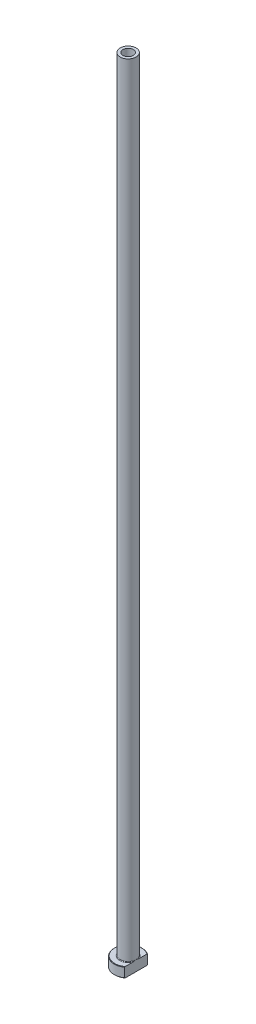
ISO-10303-21;
HEADER;
FILE_DESCRIPTION(('STEP AP214'),'2;1');
FILE_NAME('part.step','',(''),(''),'','','');
FILE_SCHEMA(('AUTOMOTIVE_DESIGN { 1 0 10303 214 1 1 1 1 }'));
ENDSEC;
DATA;
#1=APPLICATION_CONTEXT('core data for automotive mechanical design processes');
#2=APPLICATION_PROTOCOL_DEFINITION('international standard','automotive_design',2000,#1);
#3=PRODUCT_CONTEXT('',#1,'mechanical');
#4=PRODUCT('Part','Part','',(#3));
#5=PRODUCT_RELATED_PRODUCT_CATEGORY('part','',(#4));
#6=PRODUCT_DEFINITION_FORMATION('','',#4);
#7=PRODUCT_DEFINITION_CONTEXT('part definition',#1,'design');
#8=PRODUCT_DEFINITION('design','',#6,#7);
#9=PRODUCT_DEFINITION_SHAPE('','',#8);
#10=(LENGTH_UNIT() NAMED_UNIT(*) SI_UNIT(.MILLI.,.METRE.));
#11=(NAMED_UNIT(*) PLANE_ANGLE_UNIT() SI_UNIT($,.RADIAN.));
#12=(NAMED_UNIT(*) SI_UNIT($,.STERADIAN.) SOLID_ANGLE_UNIT());
#13=UNCERTAINTY_MEASURE_WITH_UNIT(LENGTH_MEASURE(1.E-05),#10,'distance_accuracy_value','');
#14=(GEOMETRIC_REPRESENTATION_CONTEXT(3) GLOBAL_UNCERTAINTY_ASSIGNED_CONTEXT((#13)) GLOBAL_UNIT_ASSIGNED_CONTEXT((#10,
#11,#12)) REPRESENTATION_CONTEXT('',''));
#15=CARTESIAN_POINT('',(0.,0.,0.));
#16=DIRECTION('',(0.,0.,1.));
#17=DIRECTION('',(1.,0.,0.));
#18=AXIS2_PLACEMENT_3D('',#15,#16,#17);
#19=CARTESIAN_POINT('',(0.,92.1876809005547,0.));
#20=DIRECTION('',(0.,1.,0.));
#21=DIRECTION('',(0.,0.,1.));
#22=AXIS2_PLACEMENT_3D('',#19,#20,#21);
#23=CYLINDRICAL_SURFACE('',#22,2.60000000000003);
#24=CARTESIAN_POINT('',(0.,400.,0.));
#25=DIRECTION('',(0.,1.,0.));
#26=DIRECTION('',(0.,0.,1.));
#27=AXIS2_PLACEMENT_3D('',#24,#25,#26);
#28=CIRCLE('',#27,2.60000000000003);
#29=CARTESIAN_POINT('',(0.,400.,2.60000000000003));
#30=VERTEX_POINT('',#29);
#31=EDGE_CURVE('E167',#30,#30,#28,.T.);
#32=ORIENTED_EDGE('',*,*,#31,.T.);
#33=EDGE_LOOP('',(#32));
#34=FACE_BOUND('',#33,.T.);
#35=CARTESIAN_POINT('',(0.,355.,0.));
#36=DIRECTION('',(0.,1.,0.));
#37=DIRECTION('',(0.,0.,1.));
#38=AXIS2_PLACEMENT_3D('',#35,#36,#37);
#39=CIRCLE('',#38,2.60000000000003);
#40=CARTESIAN_POINT('',(0.,355.,2.60000000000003));
#41=VERTEX_POINT('',#40);
#42=EDGE_CURVE('E170',#41,#41,#39,.T.);
#43=ORIENTED_EDGE('',*,*,#42,.F.);
#44=EDGE_LOOP('',(#43));
#45=FACE_BOUND('',#44,.T.);
#46=ADVANCED_FACE('F32',(#34,#45),#23,.F.);
#47=CARTESIAN_POINT('',(-2.60000000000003,400.,0.));
#48=DIRECTION('',(0.,1.,0.));
#49=DIRECTION('',(0.,0.,1.));
#50=AXIS2_PLACEMENT_3D('',#47,#48,#49);
#51=PLANE('',#50);
#52=CARTESIAN_POINT('',(0.,400.,0.));
#53=DIRECTION('',(0.,1.,0.));
#54=DIRECTION('',(0.,0.,1.));
#55=AXIS2_PLACEMENT_3D('',#52,#53,#54);
#56=CIRCLE('',#55,4.00000000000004);
#57=CARTESIAN_POINT('',(0.,400.,4.00000000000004));
#58=VERTEX_POINT('',#57);
#59=EDGE_CURVE('E174',#58,#58,#56,.T.);
#60=ORIENTED_EDGE('',*,*,#59,.T.);
#61=EDGE_LOOP('',(#60));
#62=FACE_BOUND('',#61,.T.);
#63=ORIENTED_EDGE('',*,*,#31,.F.);
#64=EDGE_LOOP('',(#63));
#65=FACE_BOUND('',#64,.T.);
#66=ADVANCED_FACE('F157',(#62,#65),#51,.T.);
#67=CARTESIAN_POINT('',(0.,92.1876809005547,0.));
#68=DIRECTION('',(0.,1.,0.));
#69=DIRECTION('',(0.,0.,1.));
#70=AXIS2_PLACEMENT_3D('',#67,#68,#69);
#71=CYLINDRICAL_SURFACE('',#70,4.00000000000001);
#72=CARTESIAN_POINT('',(0.,5.3,0.));
#73=DIRECTION('',(0.,1.,0.));
#74=DIRECTION('',(0.,0.,1.));
#75=AXIS2_PLACEMENT_3D('',#72,#73,#74);
#76=CIRCLE('',#75,4.00000000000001);
#77=CARTESIAN_POINT('',(4.00000000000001,5.3,0.));
#78=VERTEX_POINT('',#77);
#79=EDGE_CURVE('E180',#78,#78,#76,.T.);
#80=ORIENTED_EDGE('',*,*,#79,.T.);
#81=EDGE_LOOP('',(#80));
#82=FACE_BOUND('',#81,.T.);
#83=ORIENTED_EDGE('',*,*,#59,.F.);
#84=EDGE_LOOP('',(#83));
#85=FACE_BOUND('',#84,.T.);
#86=ADVANCED_FACE('F162',(#82,#85),#71,.T.);
#87=CARTESIAN_POINT('',(-3.99999999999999,5.,0.));
#88=DIRECTION('',(0.,1.,0.));
#89=DIRECTION('',(0.,0.,1.));
#90=AXIS2_PLACEMENT_3D('',#87,#88,#89);
#91=PLANE('',#90);
#92=DIRECTION('',(0.,0.,1.));
#93=VECTOR('',#92,1.);
#94=CARTESIAN_POINT('',(4.,5.,0.));
#95=LINE('',#94,#93);
#96=CARTESIAN_POINT('',(4.,5.,-5.49909083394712));
#97=VERTEX_POINT('',#96);
#98=CARTESIAN_POINT('',(4.,5.,-1.577973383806));
#99=VERTEX_POINT('',#98);
#100=EDGE_CURVE('E54',#97,#99,#95,.T.);
#101=ORIENTED_EDGE('',*,*,#100,.F.);
#102=CARTESIAN_POINT('',(0.,5.,0.));
#103=DIRECTION('',(0.,1.,0.));
#104=DIRECTION('',(0.,0.,1.));
#105=AXIS2_PLACEMENT_3D('',#102,#103,#104);
#106=CIRCLE('',#105,6.80000000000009);
#107=CARTESIAN_POINT('',(3.99999999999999,5.,5.49909083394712));
#108=VERTEX_POINT('',#107);
#109=EDGE_CURVE('E186',#97,#108,#106,.T.);
#110=ORIENTED_EDGE('',*,*,#109,.T.);
#111=CARTESIAN_POINT('',(4.,5.,1.577973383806));
#112=VERTEX_POINT('',#111);
#113=EDGE_CURVE('E134',#112,#108,#95,.T.);
#114=ORIENTED_EDGE('',*,*,#113,.F.);
#115=CARTESIAN_POINT('',(0.,5.,0.));
#116=DIRECTION('',(0.,1.,0.));
#117=DIRECTION('',(0.,0.,1.));
#118=AXIS2_PLACEMENT_3D('',#115,#116,#117);
#119=CIRCLE('',#118,4.30000000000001);
#120=EDGE_CURVE('E183',#112,#99,#119,.F.);
#121=ORIENTED_EDGE('',*,*,#120,.T.);
#122=EDGE_LOOP('',(#101,#110,#114,#121));
#123=FACE_BOUND('',#122,.T.);
#124=ADVANCED_FACE('F197',(#123),#91,.T.);
#125=CARTESIAN_POINT('',(0.,92.1876809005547,0.));
#126=DIRECTION('',(0.,1.,0.));
#127=DIRECTION('',(0.,0.,1.));
#128=AXIS2_PLACEMENT_3D('',#125,#126,#127);
#129=CYLINDRICAL_SURFACE('',#128,6.99999999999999);
#130=DIRECTION('',(0.,-1.,0.));
#131=VECTOR('',#130,1.);
#132=CARTESIAN_POINT('',(3.99999999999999,400.,5.74456264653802));
#133=LINE('',#132,#131);
#134=CARTESIAN_POINT('',(3.99999999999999,4.80000000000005,5.74456264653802));
#135=VERTEX_POINT('',#134);
#136=CARTESIAN_POINT('',(3.99999999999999,0.200000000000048,5.74456264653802));
#137=VERTEX_POINT('',#136);
#138=EDGE_CURVE('E82',#135,#137,#133,.T.);
#139=ORIENTED_EDGE('',*,*,#138,.F.);
#140=CARTESIAN_POINT('',(0.,4.80000000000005,0.));
#141=DIRECTION('',(0.,1.,0.));
#142=DIRECTION('',(0.,0.,1.));
#143=AXIS2_PLACEMENT_3D('',#140,#141,#142);
#144=CIRCLE('',#143,6.99999999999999);
#145=CARTESIAN_POINT('',(4.,4.80000000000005,-5.74456264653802));
#146=VERTEX_POINT('',#145);
#147=EDGE_CURVE('E95',#135,#146,#144,.F.);
#148=ORIENTED_EDGE('',*,*,#147,.T.);
#149=DIRECTION('',(0.,-1.,0.));
#150=VECTOR('',#149,1.);
#151=CARTESIAN_POINT('',(4.,400.,-5.74456264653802));
#152=LINE('',#151,#150);
#153=CARTESIAN_POINT('',(4.,0.200000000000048,-5.74456264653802));
#154=VERTEX_POINT('',#153);
#155=EDGE_CURVE('E192',#146,#154,#152,.T.);
#156=ORIENTED_EDGE('',*,*,#155,.T.);
#157=CARTESIAN_POINT('',(0.,0.200000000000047,0.));
#158=DIRECTION('',(0.,-1.,0.));
#159=DIRECTION('',(0.,0.,-1.));
#160=AXIS2_PLACEMENT_3D('',#157,#158,#159);
#161=CIRCLE('',#160,6.99999999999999);
#162=EDGE_CURVE('E98',#154,#137,#161,.F.);
#163=ORIENTED_EDGE('',*,*,#162,.T.);
#164=EDGE_LOOP('',(#139,#148,#156,#163));
#165=FACE_BOUND('',#164,.T.);
#166=ADVANCED_FACE('F190',(#165),#129,.T.);
#167=CARTESIAN_POINT('',(-6.99999999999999,0.,0.));
#168=DIRECTION('',(0.,-1.,0.));
#169=DIRECTION('',(0.,0.,-1.));
#170=AXIS2_PLACEMENT_3D('',#167,#168,#169);
#171=PLANE('',#170);
#172=CARTESIAN_POINT('',(0.,0.,0.));
#173=DIRECTION('',(0.,-1.,0.));
#174=DIRECTION('',(0.,0.,-1.));
#175=AXIS2_PLACEMENT_3D('',#172,#173,#174);
#176=CIRCLE('',#175,3.34999999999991);
#177=CARTESIAN_POINT('',(0.,0.,-3.34999999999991));
#178=VERTEX_POINT('',#177);
#179=EDGE_CURVE('E40',#178,#178,#176,.F.);
#180=ORIENTED_EDGE('',*,*,#179,.T.);
#181=EDGE_LOOP('',(#180));
#182=FACE_BOUND('',#181,.T.);
#183=DIRECTION('',(0.,0.,-1.));
#184=VECTOR('',#183,1.);
#185=CARTESIAN_POINT('',(3.99999999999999,0.,5.74456264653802));
#186=LINE('',#185,#184);
#187=CARTESIAN_POINT('',(3.99999999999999,0.,5.49909083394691));
#188=VERTEX_POINT('',#187);
#189=CARTESIAN_POINT('',(4.,0.,-5.49909083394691));
#190=VERTEX_POINT('',#189);
#191=EDGE_CURVE('E47',#188,#190,#186,.T.);
#192=ORIENTED_EDGE('',*,*,#191,.F.);
#193=CARTESIAN_POINT('',(0.,0.,0.));
#194=DIRECTION('',(0.,-1.,0.));
#195=DIRECTION('',(0.,0.,-1.));
#196=AXIS2_PLACEMENT_3D('',#193,#194,#195);
#197=CIRCLE('',#196,6.79999999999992);
#198=EDGE_CURVE('E92',#188,#190,#197,.T.);
#199=ORIENTED_EDGE('',*,*,#198,.T.);
#200=EDGE_LOOP('',(#192,#199));
#201=FACE_BOUND('',#200,.T.);
#202=ADVANCED_FACE('F91',(#182,#201),#171,.T.);
#203=CARTESIAN_POINT('',(0.,92.1876809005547,0.));
#204=DIRECTION('',(0.,1.,0.));
#205=DIRECTION('',(0.,0.,1.));
#206=AXIS2_PLACEMENT_3D('',#203,#204,#205);
#207=CYLINDRICAL_SURFACE('',#206,2.85000000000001);
#208=CARTESIAN_POINT('',(0.,0.499999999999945,0.));
#209=DIRECTION('',(0.,-1.,0.));
#210=DIRECTION('',(0.,0.,-1.));
#211=AXIS2_PLACEMENT_3D('',#208,#209,#210);
#212=CIRCLE('',#211,2.85000000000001);
#213=CARTESIAN_POINT('',(0.,0.499999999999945,-2.85000000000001));
#214=VERTEX_POINT('',#213);
#215=EDGE_CURVE('E11',#214,#214,#212,.T.);
#216=ORIENTED_EDGE('',*,*,#215,.T.);
#217=EDGE_LOOP('',(#216));
#218=FACE_BOUND('',#217,.T.);
#219=CARTESIAN_POINT('',(0.,343.,0.));
#220=DIRECTION('',(0.,1.,0.));
#221=DIRECTION('',(0.,0.,1.));
#222=AXIS2_PLACEMENT_3D('',#219,#220,#221);
#223=CIRCLE('',#222,2.85000000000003);
#224=CARTESIAN_POINT('',(0.,343.,2.85000000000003));
#225=VERTEX_POINT('',#224);
#226=EDGE_CURVE('E172',#225,#225,#223,.T.);
#227=ORIENTED_EDGE('',*,*,#226,.T.);
#228=EDGE_LOOP('',(#227));
#229=FACE_BOUND('',#228,.T.);
#230=ADVANCED_FACE('F215',(#218,#229),#207,.F.);
#231=CARTESIAN_POINT('',(0.,343.,0.));
#232=DIRECTION('',(0.,-1.,0.));
#233=DIRECTION('',(0.,0.,-1.));
#234=AXIS2_PLACEMENT_3D('',#231,#232,#233);
#235=CONICAL_SURFACE('',#234,2.85000000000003,0.0208303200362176);
#236=ORIENTED_EDGE('',*,*,#42,.T.);
#237=EDGE_LOOP('',(#236));
#238=FACE_BOUND('',#237,.T.);
#239=ORIENTED_EDGE('',*,*,#226,.F.);
#240=EDGE_LOOP('',(#239));
#241=FACE_BOUND('',#240,.T.);
#242=ADVANCED_FACE('F111',(#238,#241),#235,.F.);
#243=CARTESIAN_POINT('',(0.,5.3,0.));
#244=DIRECTION('',(0.,1.,0.));
#245=DIRECTION('',(0.,0.,1.));
#246=AXIS2_PLACEMENT_3D('',#243,#244,#245);
#247=TOROIDAL_SURFACE('',#246,4.30000000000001,0.3);
#248=ORIENTED_EDGE('',*,*,#120,.F.);
#249=CARTESIAN_POINT('',(4.00000000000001,5.3,0.));
#250=CARTESIAN_POINT('',(4.00000000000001,5.30000062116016,-1.06261135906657E-10));
#251=CARTESIAN_POINT('',(4.00000000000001,5.30000124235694,2.17726282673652E-07));
#252=CARTESIAN_POINT('',(4.00000000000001,5.3000024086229,8.36141475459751E-07));
#253=CARTESIAN_POINT('',(4.00000000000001,5.30000294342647,1.25011736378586E-06));
#254=CARTESIAN_POINT('',(4.00000000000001,5.30000404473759,2.2395941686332E-06));
#255=CARTESIAN_POINT('',(4.00000000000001,5.30000459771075,2.83084558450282E-06));
#256=CARTESIAN_POINT('',(4.00000000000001,5.30000559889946,4.06516712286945E-06));
#257=CARTESIAN_POINT('',(4.00000000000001,5.30000604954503,4.7064018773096E-06));
#258=CARTESIAN_POINT('',(4.00000000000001,5.30000769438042,7.15677381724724E-06));
#259=CARTESIAN_POINT('',(4.00000000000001,5.30000879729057,9.02996197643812E-06));
#260=CARTESIAN_POINT('',(4.00000000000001,5.30001063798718,1.27664912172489E-05));
#261=CARTESIAN_POINT('',(4.,5.30001139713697,1.46197829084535E-05));
#262=CARTESIAN_POINT('',(4.,5.3000145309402,2.23679261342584E-05));
#263=CARTESIAN_POINT('',(4.,5.30001683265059,2.82968803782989E-05));
#264=CARTESIAN_POINT('',(4.,5.30002027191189,3.95668793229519E-05));
#265=CARTESIAN_POINT('',(4.,5.30002152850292,4.48715518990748E-05));
#266=CARTESIAN_POINT('',(4.,5.30003060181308,8.40118292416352E-05));
#267=CARTESIAN_POINT('',(4.,5.30003739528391,0.000118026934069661));
#268=CARTESIAN_POINT('',(3.99999999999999,5.30006713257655,0.00025221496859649));
#269=CARTESIAN_POINT('',(3.99999999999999,5.30009559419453,0.000351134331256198));
#270=CARTESIAN_POINT('',(4.,5.30020622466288,0.000742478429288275));
#271=CARTESIAN_POINT('',(4.,5.30028475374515,0.00103561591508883));
#272=CARTESIAN_POINT('',(3.99999999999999,5.30059889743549,0.00219920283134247));
#273=CARTESIAN_POINT('',(3.99999999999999,5.30083905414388,0.00306873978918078));
#274=CARTESIAN_POINT('',(4.,5.30183682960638,0.00669141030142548));
#275=CARTESIAN_POINT('',(4.,5.30258877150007,0.00944568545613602));
#276=CARTESIAN_POINT('',(3.99999999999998,5.31066890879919,0.0390293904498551));
#277=CARTESIAN_POINT('',(3.99999999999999,5.31802631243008,0.0658531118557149));
#278=CARTESIAN_POINT('',(4.,5.33239676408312,0.118441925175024));
#279=CARTESIAN_POINT('',(4.,5.3394118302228,0.144206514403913));
#280=CARTESIAN_POINT('',(3.99999999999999,5.35427366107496,0.199017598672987));
#281=CARTESIAN_POINT('',(4.,5.36211313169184,0.228066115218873));
#282=CARTESIAN_POINT('',(4.,5.37776349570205,0.286511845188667));
#283=CARTESIAN_POINT('',(4.,5.38557313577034,0.315909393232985));
#284=CARTESIAN_POINT('',(4.,5.40425662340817,0.386994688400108));
#285=CARTESIAN_POINT('',(4.,5.41505237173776,0.428703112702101));
#286=CARTESIAN_POINT('',(4.,5.43592310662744,0.511098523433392));
#287=CARTESIAN_POINT('',(4.,5.44600969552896,0.551782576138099));
#288=CARTESIAN_POINT('',(4.,5.47850986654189,0.68659902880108));
#289=CARTESIAN_POINT('',(4.,5.49978370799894,0.781011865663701));
#290=CARTESIAN_POINT('',(4.,5.53807543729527,0.971847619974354));
#291=CARTESIAN_POINT('',(4.,5.55504273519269,1.06828120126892));
#292=CARTESIAN_POINT('',(4.,5.57582405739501,1.21752725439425));
#293=CARTESIAN_POINT('',(4.,5.58209796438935,1.2699937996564));
#294=CARTESIAN_POINT('',(4.,5.59210686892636,1.37516324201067));
#295=CARTESIAN_POINT('',(4.,5.59584265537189,1.42786606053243));
#296=CARTESIAN_POINT('',(4.,5.60010438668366,1.53310673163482));
#297=CARTESIAN_POINT('',(4.,5.6006487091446,1.58564378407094));
#298=CARTESIAN_POINT('',(4.,5.59767158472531,1.69058605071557));
#299=CARTESIAN_POINT('',(4.,5.59415502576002,1.74299134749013));
#300=CARTESIAN_POINT('',(4.,5.58503062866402,1.81903290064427));
#301=CARTESIAN_POINT('',(4.,5.581576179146,1.84292934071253));
#302=CARTESIAN_POINT('',(4.,5.57329952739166,1.8905106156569));
#303=CARTESIAN_POINT('',(4.,5.56847619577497,1.91419525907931));
#304=CARTESIAN_POINT('',(4.,5.55726644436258,1.96092888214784));
#305=CARTESIAN_POINT('',(4.,5.55089740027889,1.98398195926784));
#306=CARTESIAN_POINT('',(4.,5.53623434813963,2.02945550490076));
#307=CARTESIAN_POINT('',(4.,5.52794253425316,2.05187666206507));
#308=CARTESIAN_POINT('',(4.,5.50887098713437,2.09590631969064));
#309=CARTESIAN_POINT('',(4.,5.49806837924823,2.11750508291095));
#310=CARTESIAN_POINT('',(4.,5.47333401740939,2.15885583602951));
#311=CARTESIAN_POINT('',(4.,5.4594127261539,2.17861369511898));
#312=CARTESIAN_POINT('',(4.,5.43588221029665,2.2052294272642));
#313=CARTESIAN_POINT('',(4.,5.42781139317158,2.21344043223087));
#314=CARTESIAN_POINT('',(4.,5.4106511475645,2.22875149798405));
#315=CARTESIAN_POINT('',(4.,5.40156129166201,2.23585108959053));
#316=CARTESIAN_POINT('',(4.,5.38220524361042,2.24859694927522));
#317=CARTESIAN_POINT('',(4.,5.37192420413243,2.2542211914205));
#318=CARTESIAN_POINT('',(4.,5.35045072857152,2.26331064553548));
#319=CARTESIAN_POINT('',(4.,5.3392612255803,2.26678251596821));
#320=CARTESIAN_POINT('',(4.,5.31952044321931,2.27051268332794));
#321=CARTESIAN_POINT('',(4.,5.31108453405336,2.27139016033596));
#322=CARTESIAN_POINT('',(4.,5.29418624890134,2.27168963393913));
#323=CARTESIAN_POINT('',(4.,5.28572387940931,2.2711119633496));
#324=CARTESIAN_POINT('',(4.,5.26904138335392,2.26855580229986));
#325=CARTESIAN_POINT('',(4.,5.2608206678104,2.26658107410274));
#326=CARTESIAN_POINT('',(4.,5.24478214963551,2.26139496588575));
#327=CARTESIAN_POINT('',(4.,5.23696461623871,2.25818277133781));
#328=CARTESIAN_POINT('',(4.,5.21851235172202,2.249083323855));
#329=CARTESIAN_POINT('',(4.,5.20815219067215,2.24264095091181));
#330=CARTESIAN_POINT('',(4.,5.18857975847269,2.2281995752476));
#331=CARTESIAN_POINT('',(4.,5.17937061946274,2.22019647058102));
#332=CARTESIAN_POINT('',(4.,5.15665383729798,2.19777756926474));
#333=CARTESIAN_POINT('',(4.,5.14403484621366,2.18246908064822));
#334=CARTESIAN_POINT('',(4.,5.12118369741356,2.15020843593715));
#335=CARTESIAN_POINT('',(4.,5.11095480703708,2.13325407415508));
#336=CARTESIAN_POINT('',(4.,5.09273574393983,2.09892324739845));
#337=CARTESIAN_POINT('',(4.,5.08468212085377,2.0815798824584));
#338=CARTESIAN_POINT('',(4.,5.07005901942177,2.04627072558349));
#339=CARTESIAN_POINT('',(4.,5.06349101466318,2.02830433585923));
#340=CARTESIAN_POINT('',(4.,5.04555485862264,1.97350761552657));
#341=CARTESIAN_POINT('',(4.,5.0360897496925,1.93605770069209));
#342=CARTESIAN_POINT('',(4.,5.01780569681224,1.84529235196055));
#343=CARTESIAN_POINT('',(4.,5.01077018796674,1.79164082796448));
#344=CARTESIAN_POINT('',(4.,5.00182846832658,1.68379947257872));
#345=CARTESIAN_POINT('',(4.,4.99993887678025,1.6296084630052));
#346=CARTESIAN_POINT('',(4.,5.00006129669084,1.52361204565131));
#347=CARTESIAN_POINT('',(4.,5.00190698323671,1.4718055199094));
#348=CARTESIAN_POINT('',(4.,5.00841243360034,1.36835357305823));
#349=CARTESIAN_POINT('',(4.,5.01307376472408,1.31670825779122));
#350=CARTESIAN_POINT('',(4.,5.02905484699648,1.17431887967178));
#351=CARTESIAN_POINT('',(4.,5.04274090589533,1.08384207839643));
#352=CARTESIAN_POINT('',(4.,5.06701714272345,0.947757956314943));
#353=CARTESIAN_POINT('',(4.,5.07585573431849,0.901814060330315));
#354=CARTESIAN_POINT('',(4.,5.09458665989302,0.810008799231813));
#355=CARTESIAN_POINT('',(4.,5.10448180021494,0.764148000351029));
#356=CARTESIAN_POINT('',(4.,5.12892434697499,0.655631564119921));
#357=CARTESIAN_POINT('',(4.,5.14383556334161,0.593058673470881));
#358=CARTESIAN_POINT('',(3.99999999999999,5.17458762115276,0.468885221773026));
#359=CARTESIAN_POINT('',(3.99999999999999,5.19041623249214,0.407281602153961));
#360=CARTESIAN_POINT('',(4.,5.22090834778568,0.291232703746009));
#361=CARTESIAN_POINT('',(4.,5.23550024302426,0.236768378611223));
#362=CARTESIAN_POINT('',(3.99999999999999,5.26562550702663,0.125604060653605));
#363=CARTESIAN_POINT('',(3.99999999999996,5.28117250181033,0.0689076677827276));
#364=CARTESIAN_POINT('',(4.,5.29741226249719,0.00944154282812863));
#365=CARTESIAN_POINT('',(4.,5.29816540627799,0.00668315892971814));
#366=CARTESIAN_POINT('',(3.99999999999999,5.29916346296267,0.00305954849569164));
#367=CARTESIAN_POINT('',(3.99999999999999,5.29940273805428,0.00219318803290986));
#368=CARTESIAN_POINT('',(4.,5.29971580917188,0.00103357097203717));
#369=CARTESIAN_POINT('',(4.,5.29979412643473,0.000741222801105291));
#370=CARTESIAN_POINT('',(3.99999999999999,5.29990450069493,0.000350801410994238));
#371=CARTESIAN_POINT('',(3.99999999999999,5.29993292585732,0.000252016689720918));
#372=CARTESIAN_POINT('',(4.,5.29996263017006,0.000117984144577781));
#373=CARTESIAN_POINT('',(4.,5.29996941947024,8.3988198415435E-05));
#374=CARTESIAN_POINT('',(4.,5.29997848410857,4.48674068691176E-05));
#375=CARTESIAN_POINT('',(4.,5.2999797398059,3.95638248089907E-05));
#376=CARTESIAN_POINT('',(4.,5.29998317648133,2.82960387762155E-05));
#377=CARTESIAN_POINT('',(4.,5.29998547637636,2.23681491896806E-05));
#378=CARTESIAN_POINT('',(4.,5.29998860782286,1.46211021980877E-05));
#379=CARTESIAN_POINT('',(4.00000000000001,5.29998936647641,1.27678922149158E-05));
#380=CARTESIAN_POINT('',(4.00000000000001,5.29999120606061,9.03144249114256E-06));
#381=CARTESIAN_POINT('',(4.00000000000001,5.29999230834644,7.15824240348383E-06));
#382=CARTESIAN_POINT('',(4.00000000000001,5.29999395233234,4.70775615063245E-06));
#383=CARTESIAN_POINT('',(4.00000000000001,5.29999440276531,4.06646482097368E-06));
#384=CARTESIAN_POINT('',(4.00000000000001,5.29999540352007,2.83199175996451E-06));
#385=CARTESIAN_POINT('',(4.00000000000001,5.29999595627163,2.24064417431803E-06));
#386=CARTESIAN_POINT('',(4.00000000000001,5.29999705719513,1.25094025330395E-06));
#387=CARTESIAN_POINT('',(4.00000000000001,5.2999975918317,8.36841528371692E-07));
#388=CARTESIAN_POINT('',(4.00000000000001,5.29999875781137,2.1811796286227E-07));
#389=CARTESIAN_POINT('',(4.00000000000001,5.29999937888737,1.06254213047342E-10));
#390=CARTESIAN_POINT('',(4.00000000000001,5.3,0.));
#391=B_SPLINE_CURVE_WITH_KNOTS('',3,(#249,#250,#251,#252,#253,#254,#255,#256,#257,#258,#259,
#260,#261,#262,#263,#264,#265,#266,#267,#268,#269,#270,#271,#272,#273,#274,#275,#276,#277,#278,
#279,#280,#281,#282,#283,#284,#285,#286,#287,#288,#289,#290,#291,#292,#293,#294,#295,#296,#297,
#298,#299,#300,#301,#302,#303,#304,#305,#306,#307,#308,#309,#310,#311,#312,#313,#314,#315,#316,
#317,#318,#319,#320,#321,#322,#323,#324,#325,#326,#327,#328,#329,#330,#331,#332,#333,#334,#335,
#336,#337,#338,#339,#340,#341,#342,#343,#344,#345,#346,#347,#348,#349,#350,#351,#352,#353,#354,
#355,#356,#357,#358,#359,#360,#361,#362,#363,#364,#365,#366,#367,#368,#369,#370,#371,#372,#373,
#374,#375,#376,#377,#378,#379,#380,#381,#382,#383,#384,#385,#386,#387,#388,#389,#390),
.UNSPECIFIED.,.T.,.F.,(4,2,2,2,2,2,2,2,2,2,2,2,2,2,2,2,2,2,2,2,2,2,2,2,2,2,2,2,2,2,2,2,2,2,2,2,
2,2,2,2,2,2,2,2,2,2,2,2,2,2,2,2,2,2,2,2,2,2,2,2,2,2,2,2,2,2,2,2,2,2,4),(0.,1.87484163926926E-06,
3.90179571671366E-06,6.31683262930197E-06,8.66651248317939E-06,1.51627472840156E-05,
2.11657829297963E-05,4.02090679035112E-05,5.65429344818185E-05,0.00016062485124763,
0.000469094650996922,0.00137985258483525,0.00408571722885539,0.0126514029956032,
0.0960918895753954,0.176200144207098,0.266463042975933,0.357714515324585,0.486961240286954,
0.612707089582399,0.902988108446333,1.19653589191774,1.35501075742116,1.51343634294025,
1.67094875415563,1.82827177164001,1.90067591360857,1.97313996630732,2.04482437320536,
2.11642737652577,2.18871023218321,2.26075412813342,2.29521947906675,2.32969934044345,
2.36466792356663,2.39952778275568,2.42485422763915,2.45017488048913,2.47542760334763,
2.50069697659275,2.53708899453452,2.57357798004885,2.63276032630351,2.69202310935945,
2.74930315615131,2.80663977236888,2.92223125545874,3.08420752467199,3.24670629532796,
3.40212850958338,3.55763731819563,3.8319296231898,3.97228382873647,4.1130205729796,
4.3059813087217,4.49678885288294,4.66594443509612,4.84230602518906,4.85088453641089,
4.85358051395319,4.85448881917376,4.85479687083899,4.85490089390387,4.85491722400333,
4.85493626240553,4.85494226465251,4.8549487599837,4.85495110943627,4.85495352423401,
4.8549555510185,4.85495742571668),.UNSPECIFIED.);
#392=EDGE_CURVE('E126',#112,#78,#391,.T.);
#393=ORIENTED_EDGE('',*,*,#392,.T.);
#394=ORIENTED_EDGE('',*,*,#79,.F.);
#395=CARTESIAN_POINT('',(4.00000000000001,5.3,0.));
#396=CARTESIAN_POINT('',(4.00000000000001,5.29999937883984,1.06262230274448E-10));
#397=CARTESIAN_POINT('',(4.00000000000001,5.29999875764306,-2.17726281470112E-07));
#398=CARTESIAN_POINT('',(4.00000000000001,5.2999975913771,-8.36141474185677E-07));
#399=CARTESIAN_POINT('',(4.00000000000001,5.29999705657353,-1.25011736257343E-06));
#400=CARTESIAN_POINT('',(4.00000000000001,5.29999595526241,-2.23959416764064E-06));
#401=CARTESIAN_POINT('',(4.00000000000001,5.29999540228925,-2.83084558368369E-06));
#402=CARTESIAN_POINT('',(4.00000000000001,5.29999440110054,-4.06516712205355E-06));
#403=CARTESIAN_POINT('',(4.00000000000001,5.29999395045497,-4.70640187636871E-06));
#404=CARTESIAN_POINT('',(4.00000000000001,5.29999230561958,-7.1567738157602E-06));
#405=CARTESIAN_POINT('',(4.00000000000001,5.29999120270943,-9.02996197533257E-06));
#406=CARTESIAN_POINT('',(4.00000000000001,5.29998936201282,-1.27664912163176E-05));
#407=CARTESIAN_POINT('',(4.,5.29998860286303,-1.46197829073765E-05));
#408=CARTESIAN_POINT('',(4.,5.2999854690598,-2.23679261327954E-05));
#409=CARTESIAN_POINT('',(4.,5.29998316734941,-2.82968803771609E-05));
#410=CARTESIAN_POINT('',(4.,5.2999797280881,-3.95668793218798E-05));
#411=CARTESIAN_POINT('',(4.,5.29997847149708,-4.4871551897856E-05));
#412=CARTESIAN_POINT('',(4.,5.29996939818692,-8.40118292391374E-05));
#413=CARTESIAN_POINT('',(4.,5.29996260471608,-0.000118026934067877));
#414=CARTESIAN_POINT('',(3.99999999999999,5.29993286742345,-0.000252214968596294));
#415=CARTESIAN_POINT('',(3.99999999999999,5.29990440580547,-0.000351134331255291));
#416=CARTESIAN_POINT('',(4.,5.29979377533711,-0.000742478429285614));
#417=CARTESIAN_POINT('',(4.,5.29971524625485,-0.00103561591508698));
#418=CARTESIAN_POINT('',(3.99999999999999,5.29940110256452,-0.00219920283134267));
#419=CARTESIAN_POINT('',(3.99999999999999,5.29916094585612,-0.00306873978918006));
#420=CARTESIAN_POINT('',(4.,5.29816317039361,-0.00669141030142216));
#421=CARTESIAN_POINT('',(4.,5.29741122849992,-0.0094456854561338));
#422=CARTESIAN_POINT('',(3.99999999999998,5.28933109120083,-0.0390293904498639));
#423=CARTESIAN_POINT('',(3.99999999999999,5.28197368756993,-0.0658531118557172));
#424=CARTESIAN_POINT('',(4.,5.26760323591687,-0.118441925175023));
#425=CARTESIAN_POINT('',(4.,5.26058816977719,-0.144206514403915));
#426=CARTESIAN_POINT('',(3.99999999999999,5.24572633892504,-0.199017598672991));
#427=CARTESIAN_POINT('',(4.,5.23788686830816,-0.228066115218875));
#428=CARTESIAN_POINT('',(4.,5.22223650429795,-0.286511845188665));
#429=CARTESIAN_POINT('',(4.,5.21442686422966,-0.315909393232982));
#430=CARTESIAN_POINT('',(4.,5.19574337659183,-0.386994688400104));
#431=CARTESIAN_POINT('',(4.,5.18494762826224,-0.428703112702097));
#432=CARTESIAN_POINT('',(4.,5.16407689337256,-0.511098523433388));
#433=CARTESIAN_POINT('',(4.,5.15399030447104,-0.551782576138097));
#434=CARTESIAN_POINT('',(4.,5.1214901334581,-0.686599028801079));
#435=CARTESIAN_POINT('',(4.,5.10021629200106,-0.7810118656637));
#436=CARTESIAN_POINT('',(4.,5.06192456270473,-0.971847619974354));
#437=CARTESIAN_POINT('',(4.,5.04495726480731,-1.06828120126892));
#438=CARTESIAN_POINT('',(4.,5.02417594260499,-1.21752725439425));
#439=CARTESIAN_POINT('',(4.,5.01790203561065,-1.2699937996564));
#440=CARTESIAN_POINT('',(4.,5.00789313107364,-1.37516324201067));
#441=CARTESIAN_POINT('',(4.,5.00415734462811,-1.42786606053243));
#442=CARTESIAN_POINT('',(4.,4.99989561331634,-1.53310673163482));
#443=CARTESIAN_POINT('',(4.,4.9993512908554,-1.58564378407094));
#444=CARTESIAN_POINT('',(4.,5.00232841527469,-1.69058605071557));
#445=CARTESIAN_POINT('',(4.,5.00584497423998,-1.74299134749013));
#446=CARTESIAN_POINT('',(4.,5.01496937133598,-1.81903290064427));
#447=CARTESIAN_POINT('',(4.,5.018423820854,-1.84292934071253));
#448=CARTESIAN_POINT('',(4.,5.02670047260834,-1.8905106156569));
#449=CARTESIAN_POINT('',(4.,5.03152380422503,-1.9141952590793));
#450=CARTESIAN_POINT('',(4.,5.04273355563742,-1.96092888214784));
#451=CARTESIAN_POINT('',(4.,5.04910259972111,-1.98398195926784));
#452=CARTESIAN_POINT('',(4.,5.06376565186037,-2.02945550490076));
#453=CARTESIAN_POINT('',(4.,5.07205746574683,-2.05187666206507));
#454=CARTESIAN_POINT('',(4.,5.09112901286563,-2.09590631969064));
#455=CARTESIAN_POINT('',(4.,5.10193162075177,-2.11750508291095));
#456=CARTESIAN_POINT('',(4.,5.12666598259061,-2.1588558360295));
#457=CARTESIAN_POINT('',(4.,5.14058727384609,-2.17861369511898));
#458=CARTESIAN_POINT('',(4.,5.16411778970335,-2.2052294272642));
#459=CARTESIAN_POINT('',(4.,5.17218860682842,-2.21344043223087));
#460=CARTESIAN_POINT('',(4.,5.1893488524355,-2.22875149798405));
#461=CARTESIAN_POINT('',(4.,5.19843870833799,-2.23585108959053));
#462=CARTESIAN_POINT('',(4.,5.21779475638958,-2.24859694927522));
#463=CARTESIAN_POINT('',(4.,5.22807579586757,-2.2542211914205));
#464=CARTESIAN_POINT('',(4.,5.24954927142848,-2.26331064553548));
#465=CARTESIAN_POINT('',(4.,5.2607387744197,-2.26678251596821));
#466=CARTESIAN_POINT('',(4.,5.28047955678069,-2.27051268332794));
#467=CARTESIAN_POINT('',(4.,5.28891546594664,-2.27139016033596));
#468=CARTESIAN_POINT('',(4.,5.30581375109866,-2.27168963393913));
#469=CARTESIAN_POINT('',(4.,5.31427612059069,-2.2711119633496));
#470=CARTESIAN_POINT('',(4.,5.33095861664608,-2.26855580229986));
#471=CARTESIAN_POINT('',(4.,5.3391793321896,-2.26658107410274));
#472=CARTESIAN_POINT('',(4.,5.3552178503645,-2.26139496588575));
#473=CARTESIAN_POINT('',(4.,5.36303538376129,-2.2581827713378));
#474=CARTESIAN_POINT('',(4.,5.38148764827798,-2.24908332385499));
#475=CARTESIAN_POINT('',(4.,5.39184780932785,-2.2426409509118));
#476=CARTESIAN_POINT('',(4.,5.41142024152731,-2.22819957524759));
#477=CARTESIAN_POINT('',(4.,5.42062938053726,-2.22019647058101));
#478=CARTESIAN_POINT('',(4.,5.44334616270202,-2.19777756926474));
#479=CARTESIAN_POINT('',(4.,5.45596515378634,-2.18246908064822));
#480=CARTESIAN_POINT('',(4.,5.47881630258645,-2.15020843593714));
#481=CARTESIAN_POINT('',(4.,5.48904519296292,-2.13325407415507));
#482=CARTESIAN_POINT('',(4.,5.50726425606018,-2.09892324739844));
#483=CARTESIAN_POINT('',(4.,5.51531787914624,-2.08157988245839));
#484=CARTESIAN_POINT('',(4.,5.52994098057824,-2.04627072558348));
#485=CARTESIAN_POINT('',(4.,5.53650898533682,-2.02830433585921));
#486=CARTESIAN_POINT('',(4.,5.55444514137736,-1.97350761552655));
#487=CARTESIAN_POINT('',(4.,5.5639102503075,-1.93605770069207));
#488=CARTESIAN_POINT('',(4.,5.58219430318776,-1.84529235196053));
#489=CARTESIAN_POINT('',(4.,5.58922981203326,-1.79164082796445));
#490=CARTESIAN_POINT('',(4.,5.59817153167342,-1.68379947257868));
#491=CARTESIAN_POINT('',(4.,5.60006112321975,-1.62960846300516));
#492=CARTESIAN_POINT('',(4.,5.59993870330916,-1.52361204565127));
#493=CARTESIAN_POINT('',(4.,5.59809301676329,-1.47180551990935));
#494=CARTESIAN_POINT('',(4.,5.59158756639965,-1.36835357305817));
#495=CARTESIAN_POINT('',(4.,5.58692623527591,-1.31670825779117));
#496=CARTESIAN_POINT('',(4.,5.57094515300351,-1.17431887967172));
#497=CARTESIAN_POINT('',(4.,5.55725909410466,-1.08384207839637));
#498=CARTESIAN_POINT('',(4.,5.53298285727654,-0.947757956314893));
#499=CARTESIAN_POINT('',(4.,5.5241442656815,-0.901814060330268));
#500=CARTESIAN_POINT('',(4.,5.50541334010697,-0.810008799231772));
#501=CARTESIAN_POINT('',(4.,5.49551819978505,-0.764148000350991));
#502=CARTESIAN_POINT('',(4.,5.471075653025,-0.65563156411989));
#503=CARTESIAN_POINT('',(4.,5.45616443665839,-0.593058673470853));
#504=CARTESIAN_POINT('',(3.99999999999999,5.42541237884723,-0.46888522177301));
#505=CARTESIAN_POINT('',(3.99999999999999,5.40958376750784,-0.407281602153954));
#506=CARTESIAN_POINT('',(4.,5.37909165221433,-0.291232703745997));
#507=CARTESIAN_POINT('',(4.00000000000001,5.36449975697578,-0.236768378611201));
#508=CARTESIAN_POINT('',(3.99999999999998,5.3343744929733,-0.125604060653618));
#509=CARTESIAN_POINT('',(3.99999999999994,5.31882749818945,-0.0689076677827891));
#510=CARTESIAN_POINT('',(4.,5.30258773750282,-0.00944154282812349));
#511=CARTESIAN_POINT('',(4.,5.30183459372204,-0.00668315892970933));
#512=CARTESIAN_POINT('',(3.99999999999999,5.30083653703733,-0.00305954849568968));
#513=CARTESIAN_POINT('',(3.99999999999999,5.30059726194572,-0.00219318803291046));
#514=CARTESIAN_POINT('',(4.,5.30028419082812,-0.00103357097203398));
#515=CARTESIAN_POINT('',(4.,5.30020587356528,-0.000741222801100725));
#516=CARTESIAN_POINT('',(3.99999999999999,5.30009549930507,-0.000350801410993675));
#517=CARTESIAN_POINT('',(3.99999999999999,5.30006707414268,-0.000252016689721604));
#518=CARTESIAN_POINT('',(4.,5.30003736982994,-0.000117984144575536));
#519=CARTESIAN_POINT('',(4.,5.30003058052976,-8.3988198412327E-05));
#520=CARTESIAN_POINT('',(4.,5.30002151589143,-4.48674068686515E-05));
#521=CARTESIAN_POINT('',(4.,5.30002026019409,-3.95638248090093E-05));
#522=CARTESIAN_POINT('',(4.,5.30001682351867,-2.82960387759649E-05));
#523=CARTESIAN_POINT('',(4.,5.30001452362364,-2.23681491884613E-05));
#524=CARTESIAN_POINT('',(4.,5.30001139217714,-1.46211021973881E-05));
#525=CARTESIAN_POINT('',(4.00000000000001,5.30001063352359,-1.27678922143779E-05));
#526=CARTESIAN_POINT('',(4.00000000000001,5.30000879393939,-9.03144249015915E-06));
#527=CARTESIAN_POINT('',(4.00000000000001,5.30000769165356,-7.15824240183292E-06));
#528=CARTESIAN_POINT('',(4.00000000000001,5.30000604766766,-4.70775614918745E-06));
#529=CARTESIAN_POINT('',(4.00000000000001,5.30000559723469,-4.0664648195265E-06));
#530=CARTESIAN_POINT('',(4.00000000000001,5.30000459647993,-2.83199175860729E-06));
#531=CARTESIAN_POINT('',(4.00000000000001,5.30000404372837,-2.24064417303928E-06));
#532=CARTESIAN_POINT('',(4.00000000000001,5.30000294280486,-1.2509402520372E-06));
#533=CARTESIAN_POINT('',(4.00000000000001,5.30000240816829,-8.36841527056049E-07));
#534=CARTESIAN_POINT('',(4.00000000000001,5.30000124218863,-2.18117961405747E-07));
#535=CARTESIAN_POINT('',(4.00000000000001,5.30000062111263,-1.06252891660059E-10));
#536=CARTESIAN_POINT('',(4.00000000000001,5.3,0.));
#537=B_SPLINE_CURVE_WITH_KNOTS('',3,(#395,#396,#397,#398,#399,#400,#401,#402,#403,#404,#405,
#406,#407,#408,#409,#410,#411,#412,#413,#414,#415,#416,#417,#418,#419,#420,#421,#422,#423,#424,
#425,#426,#427,#428,#429,#430,#431,#432,#433,#434,#435,#436,#437,#438,#439,#440,#441,#442,#443,
#444,#445,#446,#447,#448,#449,#450,#451,#452,#453,#454,#455,#456,#457,#458,#459,#460,#461,#462,
#463,#464,#465,#466,#467,#468,#469,#470,#471,#472,#473,#474,#475,#476,#477,#478,#479,#480,#481,
#482,#483,#484,#485,#486,#487,#488,#489,#490,#491,#492,#493,#494,#495,#496,#497,#498,#499,#500,
#501,#502,#503,#504,#505,#506,#507,#508,#509,#510,#511,#512,#513,#514,#515,#516,#517,#518,#519,
#520,#521,#522,#523,#524,#525,#526,#527,#528,#529,#530,#531,#532,#533,#534,#535,#536),
.UNSPECIFIED.,.T.,.F.,(4,2,2,2,2,2,2,2,2,2,2,2,2,2,2,2,2,2,2,2,2,2,2,2,2,2,2,2,2,2,2,2,2,2,2,2,
2,2,2,2,2,2,2,2,2,2,2,2,2,2,2,2,2,2,2,2,2,2,2,2,2,2,2,2,2,2,2,2,2,2,4),(0.,1.87484163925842E-06,
3.90179571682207E-06,6.31683262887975E-06,8.66651248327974E-06,1.51627472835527E-05,
2.11657829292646E-05,4.02090679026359E-05,5.65429344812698E-05,0.000160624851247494,
0.000469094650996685,0.00137985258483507,0.00408571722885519,0.0126514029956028,
0.0960918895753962,0.176200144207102,0.266463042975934,0.357714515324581,0.48696124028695,
0.612707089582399,0.902988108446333,1.19653589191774,1.35501075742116,1.51343634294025,
1.67094875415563,1.82827177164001,1.90067591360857,1.97313996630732,2.04482437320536,
2.11642737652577,2.18871023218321,2.26075412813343,2.29521947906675,2.32969934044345,
2.36466792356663,2.39952778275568,2.42485422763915,2.45017488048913,2.47542760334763,
2.50069697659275,2.53708899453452,2.57357798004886,2.63276032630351,2.69202310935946,
2.74930315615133,2.8066397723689,2.92223125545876,3.08420752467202,3.246706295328,
3.40212850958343,3.55763731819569,3.83192962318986,3.97228382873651,4.11302057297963,
4.30598130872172,4.49678885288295,4.66594443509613,4.84230602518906,4.8508845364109,
4.85358051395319,4.85448881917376,4.85479687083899,4.85490089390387,4.85491722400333,
4.85493626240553,4.85494226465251,4.8549487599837,4.85495110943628,4.85495352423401,
4.8549555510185,4.85495742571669),.UNSPECIFIED.);
#538=EDGE_CURVE('E135',#78,#99,#537,.T.);
#539=ORIENTED_EDGE('',*,*,#538,.T.);
#540=EDGE_LOOP('',(#248,#393,#394,#539));
#541=FACE_BOUND('',#540,.T.);
#542=ADVANCED_FACE('F141',(#541),#247,.F.);
#543=CARTESIAN_POINT('',(0.,5.,0.));
#544=DIRECTION('',(0.,-1.,0.));
#545=DIRECTION('',(0.,0.,-1.));
#546=AXIS2_PLACEMENT_3D('',#543,#544,#545);
#547=CONICAL_SURFACE('',#546,6.80000000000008,0.785398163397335);
#548=CARTESIAN_POINT('',(4.,-1.45712845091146,-12.6392822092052));
#549=CARTESIAN_POINT('',(4.,-1.24364466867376,-12.4153556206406));
#550=CARTESIAN_POINT('',(4.,-1.0304243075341,-12.1911774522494));
#551=CARTESIAN_POINT('',(4.,-0.604617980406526,-11.7422167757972));
#552=CARTESIAN_POINT('',(4.,-0.392032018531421,-11.5174342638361));
#553=CARTESIAN_POINT('',(4.,0.0324624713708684,-11.0670952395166));
#554=CARTESIAN_POINT('',(4.,0.244370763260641,-10.8415385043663));
#555=CARTESIAN_POINT('',(4.,0.667290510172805,-10.3895875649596));
#556=CARTESIAN_POINT('',(4.,0.878301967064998,-10.1631933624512));
#557=CARTESIAN_POINT('',(4.,1.51385375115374,-9.47810122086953));
#558=CARTESIAN_POINT('',(4.,1.9367629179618,-9.017882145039));
#559=CARTESIAN_POINT('',(4.,2.56612335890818,-8.32309905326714));
#560=CARTESIAN_POINT('',(4.,2.77505666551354,-8.0907845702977));
#561=CARTESIAN_POINT('',(4.,3.19080254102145,-7.62426940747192));
#562=CARTESIAN_POINT('',(4.,3.39761512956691,-7.39006874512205));
#563=CARTESIAN_POINT('',(4.,3.87870763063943,-6.83891844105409));
#564=CARTESIAN_POINT('',(4.,4.15190978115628,-6.5210218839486));
#565=CARTESIAN_POINT('',(4.,4.55642425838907,-6.03960901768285));
#566=CARTESIAN_POINT('',(4.,4.69041050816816,-5.87833992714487));
#567=CARTESIAN_POINT('',(4.,4.95616531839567,-5.55398469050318));
#568=CARTESIAN_POINT('',(4.,5.08793391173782,-5.39089857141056));
#569=CARTESIAN_POINT('',(4.,5.34841712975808,-5.06288801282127));
#570=CARTESIAN_POINT('',(4.,5.47713786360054,-4.89796843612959));
#571=CARTESIAN_POINT('',(4.,5.73107494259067,-4.56545535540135));
#572=CARTESIAN_POINT('',(4.,5.85629144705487,-4.39786197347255));
#573=CARTESIAN_POINT('',(4.,6.10211465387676,-4.05948444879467));
#574=CARTESIAN_POINT('',(4.,6.2227243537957,-3.88870249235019));
#575=CARTESIAN_POINT('',(4.,6.45796076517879,-3.54308312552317));
#576=CARTESIAN_POINT('',(4.,6.57258867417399,-3.36824653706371));
#577=CARTESIAN_POINT('',(4.,6.76866603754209,-3.05381396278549));
#578=CARTESIAN_POINT('',(4.,6.85173773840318,-2.91523359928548));
#579=CARTESIAN_POINT('',(4.,7.01174537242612,-2.63451965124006));
#580=CARTESIAN_POINT('',(4.,7.08868042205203,-2.49238555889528));
#581=CARTESIAN_POINT('',(4.,7.23459437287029,-2.20416961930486));
#582=CARTESIAN_POINT('',(4.,7.30357836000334,-2.05809037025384));
#583=CARTESIAN_POINT('',(4.,7.43135520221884,-1.76151732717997));
#584=CARTESIAN_POINT('',(4.,7.49015114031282,-1.61102488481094));
#585=CARTESIAN_POINT('',(4.,7.58249315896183,-1.34142099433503));
#586=CARTESIAN_POINT('',(4.,7.61872660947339,-1.22323501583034));
#587=CARTESIAN_POINT('',(4.,7.68223354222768,-0.984492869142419));
#588=CARTESIAN_POINT('',(4.,7.70951040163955,-0.863937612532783));
#589=CARTESIAN_POINT('',(4.,7.75377914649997,-0.621342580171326));
#590=CARTESIAN_POINT('',(4.,7.77080509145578,-0.499309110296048));
#591=CARTESIAN_POINT('',(4.,7.7937877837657,-0.254194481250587));
#592=CARTESIAN_POINT('',(4.,7.79974523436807,-0.131113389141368));
#593=CARTESIAN_POINT('',(4.,7.80023957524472,0.115517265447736));
#594=CARTESIAN_POINT('',(4.,7.79473514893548,0.239066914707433));
#595=CARTESIAN_POINT('',(4.,7.77255119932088,0.485148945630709));
#596=CARTESIAN_POINT('',(4.,7.75587091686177,0.607681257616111));
#597=CARTESIAN_POINT('',(4.,7.71218353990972,0.851269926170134));
#598=CARTESIAN_POINT('',(4.,7.68514362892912,0.972320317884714));
#599=CARTESIAN_POINT('',(4.,7.62201202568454,1.21200276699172));
#600=CARTESIAN_POINT('',(4.,7.58591962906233,1.33063463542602));
#601=CARTESIAN_POINT('',(4.,7.45980070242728,1.70122439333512));
#602=CARTESIAN_POINT('',(4.,7.35572950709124,1.94843335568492));
#603=CARTESIAN_POINT('',(4.,7.1818671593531,2.31048534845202));
#604=CARTESIAN_POINT('',(4.,7.1208768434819,2.4298356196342));
#605=CARTESIAN_POINT('',(4.,6.99403531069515,2.66593629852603));
#606=CARTESIAN_POINT('',(3.99999999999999,6.92818466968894,2.78268701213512));
#607=CARTESIAN_POINT('',(3.99999999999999,6.7915787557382,3.01550895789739));
#608=CARTESIAN_POINT('',(3.99999999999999,6.72076681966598,3.13154660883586));
#609=CARTESIAN_POINT('',(3.99999999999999,6.57583116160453,3.36153379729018));
#610=CARTESIAN_POINT('',(3.99999999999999,6.50170736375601,3.47548328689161));
#611=CARTESIAN_POINT('',(3.99999999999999,6.35080982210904,3.70145107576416));
#612=CARTESIAN_POINT('',(3.99999999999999,6.27403866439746,3.8134711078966));
#613=CARTESIAN_POINT('',(3.99999999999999,6.11824120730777,4.035923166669));
#614=CARTESIAN_POINT('',(3.99999999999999,6.03921496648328,4.14635523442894));
#615=CARTESIAN_POINT('',(3.99999999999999,5.81506547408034,4.45397159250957));
#616=CARTESIAN_POINT('',(3.99999999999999,5.66782256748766,4.64961120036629));
#617=CARTESIAN_POINT('',(3.99999999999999,5.36880597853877,5.03740600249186));
#618=CARTESIAN_POINT('',(3.99999999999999,5.21703183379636,5.22956083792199));
#619=CARTESIAN_POINT('',(3.99999999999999,4.90999105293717,5.61115465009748));
#620=CARTESIAN_POINT('',(3.99999999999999,4.75472331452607,5.80059273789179));
#621=CARTESIAN_POINT('',(3.99999999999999,4.44150758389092,6.17724364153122));
#622=CARTESIAN_POINT('',(3.99999999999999,4.28355951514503,6.36445639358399));
#623=CARTESIAN_POINT('',(3.99999999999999,3.96525805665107,6.73740614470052));
#624=CARTESIAN_POINT('',(3.99999999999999,3.80490084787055,6.92313987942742));
#625=CARTESIAN_POINT('',(3.99999999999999,3.48247055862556,7.29311320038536));
#626=CARTESIAN_POINT('',(3.99999999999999,3.32039746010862,7.47735277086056));
#627=CARTESIAN_POINT('',(3.99999999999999,2.83216188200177,8.0281482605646));
#628=CARTESIAN_POINT('',(3.99999999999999,2.50391696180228,8.39285790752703));
#629=CARTESIAN_POINT('',(3.99999999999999,1.87512078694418,9.08414492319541));
#630=CARTESIAN_POINT('',(3.99999999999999,1.57491666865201,9.41103929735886));
#631=CARTESIAN_POINT('',(3.99999999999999,0.97215328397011,10.0626830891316));
#632=CARTESIAN_POINT('',(3.99999999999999,0.669593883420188,10.3874323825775));
#633=CARTESIAN_POINT('',(3.99999999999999,0.0637759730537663,11.0341169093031));
#634=CARTESIAN_POINT('',(3.99999999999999,-0.239476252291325,11.3560580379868));
#635=CARTESIAN_POINT('',(3.99999999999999,-0.847356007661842,11.9985921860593));
#636=CARTESIAN_POINT('',(3.99999999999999,-1.1519834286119,12.3191853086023));
#637=CARTESIAN_POINT('',(3.99999999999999,-1.45712845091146,12.6392822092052));
#638=B_SPLINE_CURVE_WITH_KNOTS('',3,(#548,#549,#550,#551,#552,#553,#554,#555,#556,#557,#558,
#559,#560,#561,#562,#563,#564,#565,#566,#567,#568,#569,#570,#571,#572,#573,#574,#575,#576,#577,
#578,#579,#580,#581,#582,#583,#584,#585,#586,#587,#588,#589,#590,#591,#592,#593,#594,#595,#596,
#597,#598,#599,#600,#601,#602,#603,#604,#605,#606,#607,#608,#609,#610,#611,#612,#613,#614,#615,
#616,#617,#618,#619,#620,#621,#622,#623,#624,#625,#626,#627,#628,#629,#630,#631,#632,#633,#634,
#635,#636,#637),.UNSPECIFIED.,.F.,.F.,(4,2,2,2,2,2,2,2,2,2,2,2,2,2,2,2,2,2,2,2,2,2,2,2,2,2,2,2,
2,2,2,2,2,2,2,2,2,2,2,2,2,2,2,2,4),(0.,0.92815212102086,1.85631024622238,2.78476262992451,
3.71321307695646,5.58823033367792,6.52556078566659,7.46288254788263,8.72028576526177,
9.34927045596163,9.97824580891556,10.605830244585,11.2333861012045,11.8605264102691,
12.4875406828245,12.9721363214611,13.4568016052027,13.9411551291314,14.4253618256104,
14.795914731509,15.1663277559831,15.5355031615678,15.9046551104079,16.2751400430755,
16.6456501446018,17.0173437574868,17.3890663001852,18.191399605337,18.5934522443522,
18.9954573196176,19.4032100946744,19.8109722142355,20.2183467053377,20.6257106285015,
21.3601838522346,22.0947322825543,22.8295158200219,23.5643203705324,24.3004480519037,
25.0365834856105,26.5085499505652,27.8400191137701,29.1715646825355,30.4983881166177,
31.8251080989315),.UNSPECIFIED.);
#639=EDGE_CURVE('E133',#146,#97,#638,.T.);
#640=ORIENTED_EDGE('',*,*,#639,.F.);
#641=ORIENTED_EDGE('',*,*,#147,.F.);
#642=EDGE_CURVE('E118',#108,#135,#638,.T.);
#643=ORIENTED_EDGE('',*,*,#642,.F.);
#644=ORIENTED_EDGE('',*,*,#109,.F.);
#645=EDGE_LOOP('',(#640,#641,#643,#644));
#646=FACE_BOUND('',#645,.T.);
#647=ADVANCED_FACE('F145',(#646),#547,.T.);
#648=CARTESIAN_POINT('',(0.,0.200000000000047,0.));
#649=DIRECTION('',(0.,1.,0.));
#650=DIRECTION('',(0.,0.,1.));
#651=AXIS2_PLACEMENT_3D('',#648,#649,#650);
#652=CONICAL_SURFACE('',#651,6.99999999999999,0.785398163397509);
#653=CARTESIAN_POINT('',(3.99999999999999,6.45712845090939,12.6392822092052));
#654=CARTESIAN_POINT('',(3.99999999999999,6.24364466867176,12.4153556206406));
#655=CARTESIAN_POINT('',(3.99999999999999,6.03042430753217,12.1911774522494));
#656=CARTESIAN_POINT('',(3.99999999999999,5.60461798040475,11.7422167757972));
#657=CARTESIAN_POINT('',(3.99999999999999,5.39203201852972,11.5174342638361));
#658=CARTESIAN_POINT('',(3.99999999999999,4.96753752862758,11.0670952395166));
#659=CARTESIAN_POINT('',(3.99999999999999,4.75562923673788,10.8415385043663));
#660=CARTESIAN_POINT('',(3.99999999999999,4.33270948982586,10.3895875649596));
#661=CARTESIAN_POINT('',(3.99999999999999,4.12169803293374,10.1631933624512));
#662=CARTESIAN_POINT('',(3.99999999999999,3.48614624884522,9.47810122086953));
#663=CARTESIAN_POINT('',(3.99999999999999,3.06323708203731,9.017882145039));
#664=CARTESIAN_POINT('',(3.99999999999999,2.43387664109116,8.32309905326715));
#665=CARTESIAN_POINT('',(3.99999999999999,2.22494333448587,8.09078457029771));
#666=CARTESIAN_POINT('',(3.99999999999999,1.8091974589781,7.62426940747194));
#667=CARTESIAN_POINT('',(3.99999999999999,1.60238487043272,7.39006874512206));
#668=CARTESIAN_POINT('',(3.99999999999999,1.12129236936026,6.83891844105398));
#669=CARTESIAN_POINT('',(3.99999999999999,0.848090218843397,6.52102188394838));
#670=CARTESIAN_POINT('',(3.99999999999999,0.443575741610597,6.03960901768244));
#671=CARTESIAN_POINT('',(3.99999999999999,0.30958949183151,5.87833992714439));
#672=CARTESIAN_POINT('',(3.99999999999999,0.0438346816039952,5.55398469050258));
#673=CARTESIAN_POINT('',(3.99999999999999,-0.0879339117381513,5.39089857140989));
#674=CARTESIAN_POINT('',(3.99999999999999,-0.348417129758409,5.06288801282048));
#675=CARTESIAN_POINT('',(3.99999999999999,-0.477137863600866,4.89796843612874));
#676=CARTESIAN_POINT('',(3.99999999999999,-0.731074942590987,4.56545535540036));
#677=CARTESIAN_POINT('',(3.99999999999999,-0.856291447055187,4.39786197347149));
#678=CARTESIAN_POINT('',(3.99999999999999,-1.10211465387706,4.05948444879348));
#679=CARTESIAN_POINT('',(3.99999999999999,-1.22272435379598,3.88870249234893));
#680=CARTESIAN_POINT('',(3.99999999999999,-1.45796076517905,3.54308312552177));
#681=CARTESIAN_POINT('',(3.99999999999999,-1.57258867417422,3.36824653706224));
#682=CARTESIAN_POINT('',(3.99999999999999,-1.76866603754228,3.05381396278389));
#683=CARTESIAN_POINT('',(4.,-1.85173773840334,2.91523359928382));
#684=CARTESIAN_POINT('',(4.,-2.01174537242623,2.63451965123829));
#685=CARTESIAN_POINT('',(4.,-2.0886804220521,2.49238555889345));
#686=CARTESIAN_POINT('',(4.,-2.23459437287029,2.20416961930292));
#687=CARTESIAN_POINT('',(4.,-2.30357836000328,2.05809037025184));
#688=CARTESIAN_POINT('',(4.,-2.43135520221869,1.76151732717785));
#689=CARTESIAN_POINT('',(4.,-2.4901511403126,1.61102488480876));
#690=CARTESIAN_POINT('',(4.,-2.58249315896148,1.34142099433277));
#691=CARTESIAN_POINT('',(4.,-2.61872660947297,1.22323501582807));
#692=CARTESIAN_POINT('',(4.,-2.68223354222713,0.984492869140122));
#693=CARTESIAN_POINT('',(4.,-2.70951040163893,0.863937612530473));
#694=CARTESIAN_POINT('',(4.,-2.7537791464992,0.621342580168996));
#695=CARTESIAN_POINT('',(4.,-2.77080509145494,0.499309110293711));
#696=CARTESIAN_POINT('',(4.,-2.79378778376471,0.254194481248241));
#697=CARTESIAN_POINT('',(4.,-2.799745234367,0.13111338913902));
#698=CARTESIAN_POINT('',(4.,-2.80023957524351,-0.115517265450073));
#699=CARTESIAN_POINT('',(4.,-2.7947351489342,-0.239066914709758));
#700=CARTESIAN_POINT('',(4.,-2.77255119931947,-0.485148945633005));
#701=CARTESIAN_POINT('',(4.,-2.7558709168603,-0.60768125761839));
#702=CARTESIAN_POINT('',(4.,-2.71218353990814,-0.851269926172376));
#703=CARTESIAN_POINT('',(4.,-2.68514362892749,-0.972320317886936));
#704=CARTESIAN_POINT('',(4.,-2.62201202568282,-1.2120027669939));
#705=CARTESIAN_POINT('',(4.,-2.58591962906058,-1.33063463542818));
#706=CARTESIAN_POINT('',(4.,-2.45980070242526,-1.70122439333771));
#707=CARTESIAN_POINT('',(4.,-2.35572950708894,-1.94843335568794));
#708=CARTESIAN_POINT('',(4.,-2.18186715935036,-2.31048534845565));
#709=CARTESIAN_POINT('',(4.,-2.12087684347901,-2.42983561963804));
#710=CARTESIAN_POINT('',(4.,-1.99403531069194,-2.66593629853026));
#711=CARTESIAN_POINT('',(4.,-1.92818466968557,-2.78268701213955));
#712=CARTESIAN_POINT('',(4.,-1.79157875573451,-3.01550895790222));
#713=CARTESIAN_POINT('',(4.,-1.72076681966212,-3.13154660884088));
#714=CARTESIAN_POINT('',(4.,-1.57583116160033,-3.36153379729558));
#715=CARTESIAN_POINT('',(4.,-1.50170736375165,-3.4754832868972));
#716=CARTESIAN_POINT('',(4.,-1.35080982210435,-3.70145107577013));
#717=CARTESIAN_POINT('',(4.,-1.27403866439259,-3.81347110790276));
#718=CARTESIAN_POINT('',(4.,-1.11824120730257,-4.03592316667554));
#719=CARTESIAN_POINT('',(4.,-1.03921496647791,-4.14635523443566));
#720=CARTESIAN_POINT('',(4.,-0.815065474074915,-4.45397159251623));
#721=CARTESIAN_POINT('',(4.,-0.66782256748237,-4.64961120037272));
#722=CARTESIAN_POINT('',(4.,-0.368805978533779,-5.03740600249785));
#723=CARTESIAN_POINT('',(4.,-0.217031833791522,-5.22956083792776));
#724=CARTESIAN_POINT('',(4.,0.0900089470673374,-5.61115465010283));
#725=CARTESIAN_POINT('',(4.,0.245276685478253,-5.80059273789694));
#726=CARTESIAN_POINT('',(4.,0.558492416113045,-6.17724364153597));
#727=CARTESIAN_POINT('',(4.,0.716440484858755,-6.36445639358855));
#728=CARTESIAN_POINT('',(4.,1.03474194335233,-6.73740614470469));
#729=CARTESIAN_POINT('',(4.,1.19509915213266,-6.9231398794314));
#730=CARTESIAN_POINT('',(4.,1.51752944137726,-7.29311320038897));
#731=CARTESIAN_POINT('',(4.,1.67960253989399,-7.47735277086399));
#732=CARTESIAN_POINT('',(4.,2.16783811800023,-8.02814826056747));
#733=CARTESIAN_POINT('',(4.,2.4960830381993,-8.39285790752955));
#734=CARTESIAN_POINT('',(4.,3.12487921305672,-9.08414492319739));
#735=CARTESIAN_POINT('',(4.,3.42508333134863,-9.41103929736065));
#736=CARTESIAN_POINT('',(4.,4.02784671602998,-10.0626830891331));
#737=CARTESIAN_POINT('',(4.,4.33040611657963,-10.3874323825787));
#738=CARTESIAN_POINT('',(4.,4.93622402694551,-11.0341169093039));
#739=CARTESIAN_POINT('',(4.,5.23947625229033,-11.3560580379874));
#740=CARTESIAN_POINT('',(4.,5.84735600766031,-11.9985921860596));
#741=CARTESIAN_POINT('',(4.,6.15198342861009,-12.3191853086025));
#742=CARTESIAN_POINT('',(4.,6.45712845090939,-12.6392822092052));
#743=B_SPLINE_CURVE_WITH_KNOTS('',3,(#653,#654,#655,#656,#657,#658,#659,#660,#661,#662,#663,
#664,#665,#666,#667,#668,#669,#670,#671,#672,#673,#674,#675,#676,#677,#678,#679,#680,#681,#682,
#683,#684,#685,#686,#687,#688,#689,#690,#691,#692,#693,#694,#695,#696,#697,#698,#699,#700,#701,
#702,#703,#704,#705,#706,#707,#708,#709,#710,#711,#712,#713,#714,#715,#716,#717,#718,#719,#720,
#721,#722,#723,#724,#725,#726,#727,#728,#729,#730,#731,#732,#733,#734,#735,#736,#737,#738,#739,
#740,#741,#742),.UNSPECIFIED.,.F.,.F.,(4,2,2,2,2,2,2,2,2,2,2,2,2,2,2,2,2,2,2,2,2,2,2,2,2,2,2,2,
2,2,2,2,2,2,2,2,2,2,2,2,2,2,2,2,4),(0.,0.928152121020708,1.85631024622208,2.78476262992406,
3.71321307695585,5.58823033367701,6.52556078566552,7.46288254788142,8.72028576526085,
9.34927045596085,9.97824580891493,10.6058302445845,11.2333861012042,11.8605264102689,
12.4875406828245,12.9721363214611,13.4568016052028,13.9411551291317,14.4253618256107,
14.7959147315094,15.1663277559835,15.5355031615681,15.9046551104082,16.2751400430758,
16.6456501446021,17.0173437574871,17.3890663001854,18.1913996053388,18.5934522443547,
18.9954573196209,19.4032100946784,19.8109722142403,20.2183467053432,20.6257106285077,
21.36018385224,22.0947322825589,22.8295158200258,23.5643203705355,24.3004480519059,
25.0365834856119,26.508549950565,27.8400191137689,29.1715646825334,30.4983881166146,
31.8251080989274),.UNSPECIFIED.);
#744=EDGE_CURVE('E79',#137,#188,#743,.T.);
#745=ORIENTED_EDGE('',*,*,#744,.F.);
#746=ORIENTED_EDGE('',*,*,#162,.F.);
#747=EDGE_CURVE('E87',#190,#154,#743,.T.);
#748=ORIENTED_EDGE('',*,*,#747,.F.);
#749=ORIENTED_EDGE('',*,*,#198,.F.);
#750=EDGE_LOOP('',(#745,#746,#748,#749));
#751=FACE_BOUND('',#750,.T.);
#752=ADVANCED_FACE('F94',(#751),#652,.T.);
#753=CARTESIAN_POINT('',(3.99999999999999,400.,5.74456264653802));
#754=DIRECTION('',(-1.,0.,0.));
#755=DIRECTION('',(0.,0.,1.));
#756=AXIS2_PLACEMENT_3D('',#753,#754,#755);
#757=PLANE('',#756);
#758=ORIENTED_EDGE('',*,*,#392,.F.);
#759=ORIENTED_EDGE('',*,*,#113,.T.);
#760=ORIENTED_EDGE('',*,*,#642,.T.);
#761=ORIENTED_EDGE('',*,*,#138,.T.);
#762=ORIENTED_EDGE('',*,*,#744,.T.);
#763=ORIENTED_EDGE('',*,*,#191,.T.);
#764=ORIENTED_EDGE('',*,*,#747,.T.);
#765=ORIENTED_EDGE('',*,*,#155,.F.);
#766=ORIENTED_EDGE('',*,*,#639,.T.);
#767=ORIENTED_EDGE('',*,*,#100,.T.);
#768=ORIENTED_EDGE('',*,*,#538,.F.);
#769=EDGE_LOOP('',(#758,#759,#760,#761,#762,#763,#764,#765,#766,#767,#768));
#770=FACE_BOUND('',#769,.T.);
#771=ADVANCED_FACE('F80',(#770),#757,.F.);
#772=CARTESIAN_POINT('',(0.,0.,0.));
#773=DIRECTION('',(0.,-1.,0.));
#774=DIRECTION('',(0.,0.,-1.));
#775=AXIS2_PLACEMENT_3D('',#772,#773,#774);
#776=CONICAL_SURFACE('',#775,3.34999999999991,0.785398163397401);
#777=ORIENTED_EDGE('',*,*,#215,.F.);
#778=EDGE_LOOP('',(#777));
#779=FACE_BOUND('',#778,.T.);
#780=ORIENTED_EDGE('',*,*,#179,.F.);
#781=EDGE_LOOP('',(#780));
#782=FACE_BOUND('',#781,.T.);
#783=ADVANCED_FACE('F34',(#779,#782),#776,.F.);
#784=CLOSED_SHELL('',(#46,#66,#86,#124,#166,#202,#230,#242,#542,#647,#752,#771,#783));
#785=MANIFOLD_SOLID_BREP('B2',#784);
#786=ADVANCED_BREP_SHAPE_REPRESENTATION('',(#18,#785),#14);
#787=SHAPE_DEFINITION_REPRESENTATION(#9,#786);
ENDSEC;
END-ISO-10303-21;
